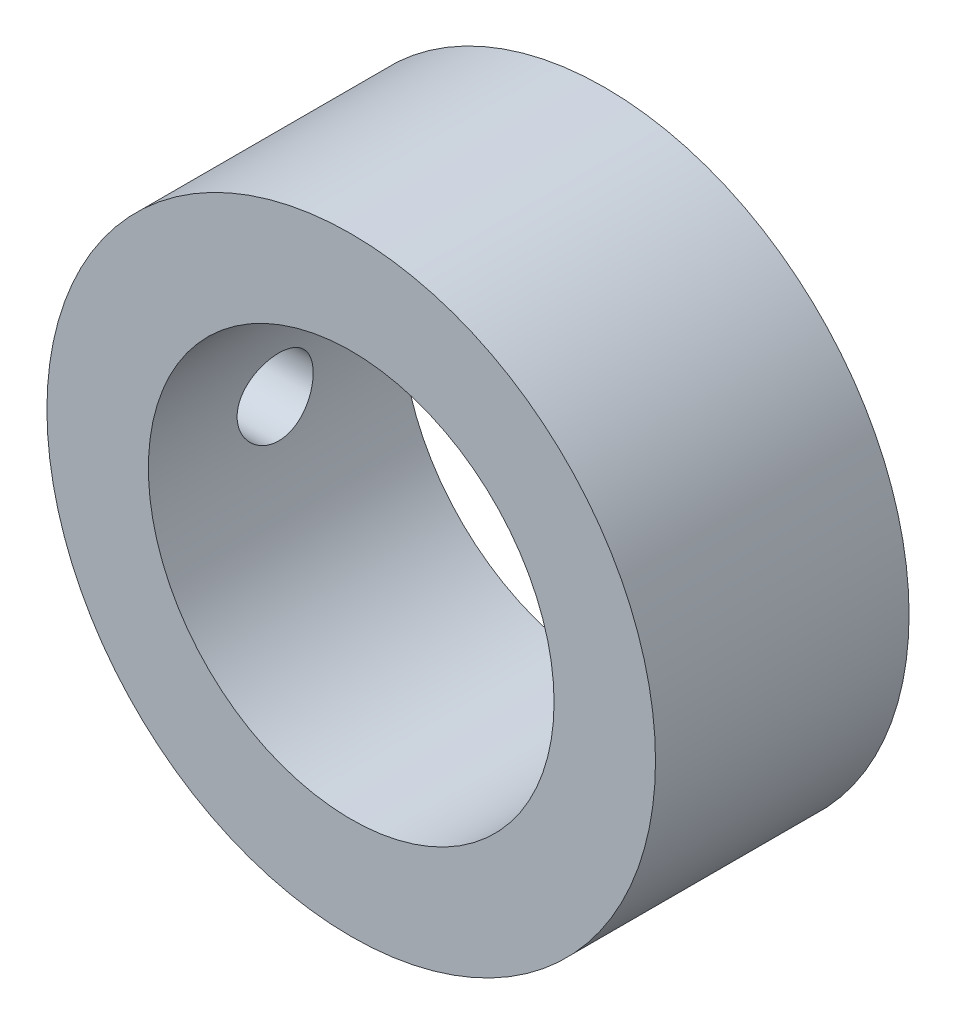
ISO-10303-21;
HEADER;
FILE_DESCRIPTION(('STEP AP214'),'2;1');
FILE_NAME('part.step','',(''),(''),'','','');
FILE_SCHEMA(('AUTOMOTIVE_DESIGN { 1 0 10303 214 1 1 1 1 }'));
ENDSEC;
DATA;
#1=APPLICATION_CONTEXT('core data for automotive mechanical design processes');
#2=APPLICATION_PROTOCOL_DEFINITION('international standard','automotive_design',2000,#1);
#3=PRODUCT_CONTEXT('',#1,'mechanical');
#4=PRODUCT('Part','Part','',(#3));
#5=PRODUCT_RELATED_PRODUCT_CATEGORY('part','',(#4));
#6=PRODUCT_DEFINITION_FORMATION('','',#4);
#7=PRODUCT_DEFINITION_CONTEXT('part definition',#1,'design');
#8=PRODUCT_DEFINITION('design','',#6,#7);
#9=PRODUCT_DEFINITION_SHAPE('','',#8);
#10=(LENGTH_UNIT() NAMED_UNIT(*) SI_UNIT(.MILLI.,.METRE.));
#11=(NAMED_UNIT(*) PLANE_ANGLE_UNIT() SI_UNIT($,.RADIAN.));
#12=(NAMED_UNIT(*) SI_UNIT($,.STERADIAN.) SOLID_ANGLE_UNIT());
#13=UNCERTAINTY_MEASURE_WITH_UNIT(LENGTH_MEASURE(1.E-05),#10,'distance_accuracy_value','');
#14=(GEOMETRIC_REPRESENTATION_CONTEXT(3) GLOBAL_UNCERTAINTY_ASSIGNED_CONTEXT((#13)) GLOBAL_UNIT_ASSIGNED_CONTEXT((#10,
#11,#12)) REPRESENTATION_CONTEXT('',''));
#15=CARTESIAN_POINT('',(0.,0.,0.));
#16=DIRECTION('',(0.,0.,1.));
#17=DIRECTION('',(1.,0.,0.));
#18=AXIS2_PLACEMENT_3D('',#15,#16,#17);
#19=CARTESIAN_POINT('',(0.,0.,5.));
#20=DIRECTION('',(0.,0.,1.));
#21=DIRECTION('',(1.,0.,0.));
#22=AXIS2_PLACEMENT_3D('',#19,#20,#21);
#23=PLANE('',#22);
#24=CARTESIAN_POINT('',(0.,0.,5.));
#25=DIRECTION('',(0.,0.,1.));
#26=DIRECTION('',(1.,0.,0.));
#27=AXIS2_PLACEMENT_3D('',#24,#25,#26);
#28=CIRCLE('',#27,6.);
#29=CARTESIAN_POINT('',(6.,0.,5.));
#30=VERTEX_POINT('',#29);
#31=EDGE_CURVE('E51',#30,#30,#28,.T.);
#32=ORIENTED_EDGE('',*,*,#31,.T.);
#33=EDGE_LOOP('',(#32));
#34=FACE_BOUND('',#33,.T.);
#35=CARTESIAN_POINT('',(0.,0.,5.));
#36=DIRECTION('',(0.,0.,1.));
#37=DIRECTION('',(1.,0.,0.));
#38=AXIS2_PLACEMENT_3D('',#35,#36,#37);
#39=CIRCLE('',#38,4.);
#40=CARTESIAN_POINT('',(4.,0.,5.));
#41=VERTEX_POINT('',#40);
#42=EDGE_CURVE('E60',#41,#41,#39,.T.);
#43=ORIENTED_EDGE('',*,*,#42,.F.);
#44=EDGE_LOOP('',(#43));
#45=FACE_BOUND('',#44,.T.);
#46=ADVANCED_FACE('F39',(#34,#45),#23,.T.);
#47=CARTESIAN_POINT('',(0.,0.,0.));
#48=DIRECTION('',(0.,0.,1.));
#49=DIRECTION('',(1.,0.,0.));
#50=AXIS2_PLACEMENT_3D('',#47,#48,#49);
#51=PLANE('',#50);
#52=CARTESIAN_POINT('',(0.,0.,0.));
#53=DIRECTION('',(0.,0.,1.));
#54=DIRECTION('',(1.,0.,0.));
#55=AXIS2_PLACEMENT_3D('',#52,#53,#54);
#56=CIRCLE('',#55,6.);
#57=CARTESIAN_POINT('',(6.,0.,0.));
#58=VERTEX_POINT('',#57);
#59=EDGE_CURVE('E55',#58,#58,#56,.T.);
#60=ORIENTED_EDGE('',*,*,#59,.F.);
#61=EDGE_LOOP('',(#60));
#62=FACE_BOUND('',#61,.T.);
#63=CARTESIAN_POINT('',(0.,0.,0.));
#64=DIRECTION('',(0.,0.,1.));
#65=DIRECTION('',(1.,0.,0.));
#66=AXIS2_PLACEMENT_3D('',#63,#64,#65);
#67=CIRCLE('',#66,4.);
#68=CARTESIAN_POINT('',(4.,0.,0.));
#69=VERTEX_POINT('',#68);
#70=EDGE_CURVE('E62',#69,#69,#67,.T.);
#71=ORIENTED_EDGE('',*,*,#70,.T.);
#72=EDGE_LOOP('',(#71));
#73=FACE_BOUND('',#72,.T.);
#74=ADVANCED_FACE('F87',(#62,#73),#51,.F.);
#75=CARTESIAN_POINT('',(0.,0.,5.));
#76=DIRECTION('',(0.,0.,-1.));
#77=DIRECTION('',(-1.,0.,0.));
#78=AXIS2_PLACEMENT_3D('',#75,#76,#77);
#79=CYLINDRICAL_SURFACE('',#78,6.);
#80=CARTESIAN_POINT('',(-6.,0.,3.25));
#81=CARTESIAN_POINT('',(-5.99999941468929,-0.0419523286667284,3.24999821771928));
#82=CARTESIAN_POINT('',(-5.99955535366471,-0.0839308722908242,3.24646813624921));
#83=CARTESIAN_POINT('',(-5.99782662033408,-0.166719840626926,3.23244167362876));
#84=CARTESIAN_POINT('',(-5.99654107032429,-0.207528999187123,3.22193801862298));
#85=CARTESIAN_POINT('',(-5.99327418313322,-0.286768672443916,3.19427870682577));
#86=CARTESIAN_POINT('',(-5.99129331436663,-0.325200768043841,3.17712752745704));
#87=CARTESIAN_POINT('',(-5.98685610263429,-0.39863384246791,3.13666981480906));
#88=CARTESIAN_POINT('',(-5.98439984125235,-0.433635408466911,3.11336433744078));
#89=CARTESIAN_POINT('',(-5.97927096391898,-0.499413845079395,3.06112241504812));
#90=CARTESIAN_POINT('',(-5.97659734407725,-0.530169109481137,3.03215886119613));
#91=CARTESIAN_POINT('',(-5.97134317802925,-0.586395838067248,2.96948115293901));
#92=CARTESIAN_POINT('',(-5.96876263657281,-0.611867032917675,2.93576675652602));
#93=CARTESIAN_POINT('',(-5.96397691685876,-0.656883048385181,2.8644040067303));
#94=CARTESIAN_POINT('',(-5.96177303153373,-0.676407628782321,2.82674279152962));
#95=CARTESIAN_POINT('',(-5.95800338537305,-0.708846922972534,2.74864388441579));
#96=CARTESIAN_POINT('',(-5.95643760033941,-0.721761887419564,2.70820629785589));
#97=CARTESIAN_POINT('',(-5.95413101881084,-0.740549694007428,2.62592674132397));
#98=CARTESIAN_POINT('',(-5.95338595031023,-0.74645901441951,2.58409322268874));
#99=CARTESIAN_POINT('',(-5.95279208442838,-0.751180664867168,2.50002212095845));
#100=CARTESIAN_POINT('',(-5.95294325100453,-0.749993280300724,2.45778455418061));
#101=CARTESIAN_POINT('',(-5.95412086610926,-0.74058517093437,2.37435855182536));
#102=CARTESIAN_POINT('',(-5.95514231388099,-0.732404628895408,2.33316550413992));
#103=CARTESIAN_POINT('',(-5.95793759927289,-0.709305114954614,2.2527414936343));
#104=CARTESIAN_POINT('',(-5.95971145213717,-0.69438600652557,2.21351057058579));
#105=CARTESIAN_POINT('',(-5.96381734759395,-0.658189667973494,2.13799960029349));
#106=CARTESIAN_POINT('',(-5.96615091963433,-0.63689497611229,2.1017280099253));
#107=CARTESIAN_POINT('',(-5.97111213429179,-0.588564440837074,2.03325799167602));
#108=CARTESIAN_POINT('',(-5.97373979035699,-0.561528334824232,2.0010597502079));
#109=CARTESIAN_POINT('',(-5.97901532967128,-0.502259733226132,1.94141718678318));
#110=CARTESIAN_POINT('',(-5.98166322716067,-0.469992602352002,1.9140072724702));
#111=CARTESIAN_POINT('',(-5.98666389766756,-0.401297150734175,1.86498733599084));
#112=CARTESIAN_POINT('',(-5.98901667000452,-0.364868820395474,1.8433773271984));
#113=CARTESIAN_POINT('',(-5.99316345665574,-0.288858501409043,1.80657060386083));
#114=CARTESIAN_POINT('',(-5.99495728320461,-0.249275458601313,1.79137604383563));
#115=CARTESIAN_POINT('',(-5.99778235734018,-0.168092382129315,1.76785885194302));
#116=CARTESIAN_POINT('',(-5.99881364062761,-0.126492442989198,1.75953589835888));
#117=CARTESIAN_POINT('',(-5.99999278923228,-0.0427539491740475,1.75004277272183));
#118=CARTESIAN_POINT('',(-6.00014650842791,-0.000620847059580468,1.74882520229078));
#119=CARTESIAN_POINT('',(-5.99956901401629,0.0832488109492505,1.75345232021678));
#120=CARTESIAN_POINT('',(-5.99883781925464,0.124985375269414,1.75929685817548));
#121=CARTESIAN_POINT('',(-5.99657630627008,0.206737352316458,1.77784291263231));
#122=CARTESIAN_POINT('',(-5.99504862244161,0.246757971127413,1.79052182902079));
#123=CARTESIAN_POINT('',(-5.99136516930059,0.324104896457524,1.82235323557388));
#124=CARTESIAN_POINT('',(-5.98920937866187,0.361431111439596,1.84150594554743));
#125=CARTESIAN_POINT('',(-5.98449546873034,0.432541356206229,1.88585594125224));
#126=CARTESIAN_POINT('',(-5.98193533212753,0.466306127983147,1.91108388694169));
#127=CARTESIAN_POINT('',(-5.97670542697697,0.529139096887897,1.96682484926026));
#128=CARTESIAN_POINT('',(-5.9740356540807,0.558207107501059,1.9973380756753));
#129=CARTESIAN_POINT('',(-5.96886931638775,0.610989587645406,2.06299222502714));
#130=CARTESIAN_POINT('',(-5.96637382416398,0.634672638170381,2.09815850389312));
#131=CARTESIAN_POINT('',(-5.96185623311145,0.675795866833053,2.17199747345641));
#132=CARTESIAN_POINT('',(-5.95983412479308,0.693236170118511,2.21067009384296));
#133=CARTESIAN_POINT('',(-5.95649955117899,0.721327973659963,2.29032259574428));
#134=CARTESIAN_POINT('',(-5.95518523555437,0.731997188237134,2.33129614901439));
#135=CARTESIAN_POINT('',(-5.95340974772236,0.746300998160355,2.4144707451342));
#136=CARTESIAN_POINT('',(-5.95294853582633,0.74993592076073,2.4566717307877));
#137=CARTESIAN_POINT('',(-5.95293263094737,0.750061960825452,2.5407906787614));
#138=CARTESIAN_POINT('',(-5.95337167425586,0.746602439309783,2.58270857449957));
#139=CARTESIAN_POINT('',(-5.9550933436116,0.732742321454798,2.66536213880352));
#140=CARTESIAN_POINT('',(-5.95637596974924,0.722341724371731,2.70609780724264));
#141=CARTESIAN_POINT('',(-5.95963834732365,0.694910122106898,2.78522408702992));
#142=CARTESIAN_POINT('',(-5.96161784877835,0.677881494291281,2.82361553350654));
#143=CARTESIAN_POINT('',(-5.96605134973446,0.637682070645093,2.8970039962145));
#144=CARTESIAN_POINT('',(-5.96850535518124,0.614511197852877,2.93200096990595));
#145=CARTESIAN_POINT('',(-5.9736318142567,0.562501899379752,2.99785936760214));
#146=CARTESIAN_POINT('',(-5.9763056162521,0.533626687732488,3.02869163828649));
#147=CARTESIAN_POINT('',(-5.9815584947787,0.471105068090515,3.08509204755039));
#148=CARTESIAN_POINT('',(-5.98413754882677,0.437457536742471,3.11065894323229));
#149=CARTESIAN_POINT('',(-5.98892116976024,0.366199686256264,3.15588560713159));
#150=CARTESIAN_POINT('',(-5.9911242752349,0.328574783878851,3.17552254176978));
#151=CARTESIAN_POINT('',(-5.99489294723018,0.250554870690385,3.20817137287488));
#152=CARTESIAN_POINT('',(-5.99645920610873,0.210162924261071,3.22119046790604));
#153=CARTESIAN_POINT('',(-5.99840016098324,0.141301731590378,3.23711780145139));
#154=CARTESIAN_POINT('',(-5.99899717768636,0.113266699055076,3.24194168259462));
#155=CARTESIAN_POINT('',(-5.99979729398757,0.0568251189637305,3.24838337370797));
#156=CARTESIAN_POINT('',(-6.00000039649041,0.0284185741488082,3.25000120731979));
#157=CARTESIAN_POINT('',(-6.,0.,3.25));
#158=B_SPLINE_CURVE_WITH_KNOTS('',3,(#80,#81,#82,#83,#84,#85,#86,#87,#88,#89,#90,#91,#92,#93,
#94,#95,#96,#97,#98,#99,#100,#101,#102,#103,#104,#105,#106,#107,#108,#109,#110,#111,#112,#113,
#114,#115,#116,#117,#118,#119,#120,#121,#122,#123,#124,#125,#126,#127,#128,#129,#130,#131,#132,
#133,#134,#135,#136,#137,#138,#139,#140,#141,#142,#143,#144,#145,#146,#147,#148,#149,#150,#151,
#152,#153,#154,#155,#156,#157),.UNSPECIFIED.,.T.,.F.,(4,2,2,2,2,2,2,2,2,2,2,2,2,2,2,2,2,2,2,2,2,
2,2,2,2,2,2,2,2,2,2,2,2,2,2,2,2,2,4),(0.,0.125753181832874,0.251637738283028,0.377437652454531,
0.503215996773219,0.629612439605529,0.756015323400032,0.882843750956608,1.00966736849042,
1.13582767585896,1.26198290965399,1.38741808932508,1.51285581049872,1.6386402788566,
1.76443050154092,1.89109043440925,2.01775065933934,2.14445338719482,2.27115018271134,
2.39700083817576,2.52284881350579,2.64828316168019,2.77372176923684,2.89980720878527,
3.02589765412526,3.15270591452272,3.27951163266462,3.40598422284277,3.53245092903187,
3.65804070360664,3.78363049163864,3.90917527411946,4.03472162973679,4.16110571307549,
4.28751959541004,4.41441420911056,4.5411704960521,4.62635652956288,4.71154193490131),.UNSPECIFIED.);
#159=CARTESIAN_POINT('',(-6.,0.,3.25));
#160=VERTEX_POINT('',#159);
#161=EDGE_CURVE('E10',#160,#160,#158,.T.);
#162=ORIENTED_EDGE('',*,*,#161,.T.);
#163=EDGE_LOOP('',(#162));
#164=FACE_BOUND('',#163,.T.);
#165=ORIENTED_EDGE('',*,*,#31,.F.);
#166=EDGE_LOOP('',(#165));
#167=FACE_BOUND('',#166,.T.);
#168=ORIENTED_EDGE('',*,*,#59,.T.);
#169=EDGE_LOOP('',(#168));
#170=FACE_BOUND('',#169,.T.);
#171=ADVANCED_FACE('F41',(#164,#167,#170),#79,.T.);
#172=CARTESIAN_POINT('',(0.,0.,5.));
#173=DIRECTION('',(0.,0.,-1.));
#174=DIRECTION('',(-1.,0.,0.));
#175=AXIS2_PLACEMENT_3D('',#172,#173,#174);
#176=CYLINDRICAL_SURFACE('',#175,4.);
#177=CARTESIAN_POINT('',(-4.,0.,3.25));
#178=CARTESIAN_POINT('',(-3.99999924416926,-0.0417358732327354,3.24999840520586));
#179=CARTESIAN_POINT('',(-3.99934004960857,-0.0834924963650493,3.24650446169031));
#180=CARTESIAN_POINT('',(-3.9967739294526,-0.165829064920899,3.23263000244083));
#181=CARTESIAN_POINT('',(-3.99486595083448,-0.206407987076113,3.22224367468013));
#182=CARTESIAN_POINT('',(-3.99001569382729,-0.285186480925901,3.19491364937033));
#183=CARTESIAN_POINT('',(-3.98707434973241,-0.323388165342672,3.17797587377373));
#184=CARTESIAN_POINT('',(-3.98047855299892,-0.396403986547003,3.13804056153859));
#185=CARTESIAN_POINT('',(-3.97682415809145,-0.431218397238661,3.11504351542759));
#186=CARTESIAN_POINT('',(-3.96915668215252,-0.496891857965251,3.06335011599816));
#187=CARTESIAN_POINT('',(-3.96514017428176,-0.527704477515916,3.03459527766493));
#188=CARTESIAN_POINT('',(-3.95722659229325,-0.584098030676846,2.97232834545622));
#189=CARTESIAN_POINT('',(-3.95332952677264,-0.609678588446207,2.93881591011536));
#190=CARTESIAN_POINT('',(-3.94606275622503,-0.655074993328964,2.86765695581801));
#191=CARTESIAN_POINT('',(-3.94269746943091,-0.674843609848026,2.82997981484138));
#192=CARTESIAN_POINT('',(-3.93692356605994,-0.707752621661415,2.7517655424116));
#193=CARTESIAN_POINT('',(-3.93451486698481,-0.72089358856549,2.71122865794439));
#194=CARTESIAN_POINT('',(-3.93096134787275,-0.7400252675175,2.62894238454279));
#195=CARTESIAN_POINT('',(-3.92980222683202,-0.746096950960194,2.58721245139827));
#196=CARTESIAN_POINT('',(-3.92883598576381,-0.751169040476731,2.50331130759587));
#197=CARTESIAN_POINT('',(-3.9290287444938,-0.750170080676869,2.46114013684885));
#198=CARTESIAN_POINT('',(-3.93073146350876,-0.741194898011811,2.37814023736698));
#199=CARTESIAN_POINT('',(-3.93222404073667,-0.733310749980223,2.33730114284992));
#200=CARTESIAN_POINT('',(-3.93633091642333,-0.710933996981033,2.25753579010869));
#201=CARTESIAN_POINT('',(-3.93894526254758,-0.696441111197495,2.21860961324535));
#202=CARTESIAN_POINT('',(-3.94501927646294,-0.661168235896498,2.14350566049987));
#203=CARTESIAN_POINT('',(-3.94848391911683,-0.640351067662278,2.10734576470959));
#204=CARTESIAN_POINT('',(-3.95586485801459,-0.593046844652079,2.03899763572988));
#205=CARTESIAN_POINT('',(-3.95978120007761,-0.566559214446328,2.0068098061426));
#206=CARTESIAN_POINT('',(-3.96770000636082,-0.508169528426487,1.94678752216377));
#207=CARTESIAN_POINT('',(-3.97170285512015,-0.476188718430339,1.91902967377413));
#208=CARTESIAN_POINT('',(-3.97928693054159,-0.407984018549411,1.8692613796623));
#209=CARTESIAN_POINT('',(-3.98286815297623,-0.371760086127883,1.84725099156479));
#210=CARTESIAN_POINT('',(-3.98921269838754,-0.296017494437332,1.80959112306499));
#211=CARTESIAN_POINT('',(-3.99197499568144,-0.256494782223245,1.79394961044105));
#212=CARTESIAN_POINT('',(-3.9963625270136,-0.175319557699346,1.76954895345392));
#213=CARTESIAN_POINT('',(-3.99798788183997,-0.133667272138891,1.76078907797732));
#214=CARTESIAN_POINT('',(-3.9999018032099,-0.0500743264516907,1.75050698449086));
#215=CARTESIAN_POINT('',(-4.00020975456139,-0.00814700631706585,1.74887980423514));
#216=CARTESIAN_POINT('',(-3.99950771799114,0.0753806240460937,1.75262773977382));
#217=CARTESIAN_POINT('',(-3.99849779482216,0.116980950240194,1.75800251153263));
#218=CARTESIAN_POINT('',(-3.99528555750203,0.19834078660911,1.77551451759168));
#219=CARTESIAN_POINT('',(-3.99309261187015,0.238112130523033,1.78759864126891));
#220=CARTESIAN_POINT('',(-3.98775921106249,0.315064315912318,1.81812885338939));
#221=CARTESIAN_POINT('',(-3.98461869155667,0.352244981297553,1.83657537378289));
#222=CARTESIAN_POINT('',(-3.97769015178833,0.423408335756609,1.87953906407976));
#223=CARTESIAN_POINT('',(-3.97389543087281,0.457351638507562,1.90412036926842));
#224=CARTESIAN_POINT('',(-3.96609671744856,0.520669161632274,1.95856906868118));
#225=CARTESIAN_POINT('',(-3.96209270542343,0.550042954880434,1.98843695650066));
#226=CARTESIAN_POINT('',(-3.95426237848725,0.603786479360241,2.05308615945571));
#227=CARTESIAN_POINT('',(-3.95043912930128,0.628084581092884,2.08792745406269));
#228=CARTESIAN_POINT('',(-3.94346492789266,0.670483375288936,2.16125881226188));
#229=CARTESIAN_POINT('',(-3.94031395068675,0.688584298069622,2.19974874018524));
#230=CARTESIAN_POINT('',(-3.93506512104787,0.717973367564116,2.27910293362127));
#231=CARTESIAN_POINT('',(-3.93296220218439,0.729294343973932,2.31995468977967));
#232=CARTESIAN_POINT('',(-3.93003601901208,0.744903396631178,2.4030236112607));
#233=CARTESIAN_POINT('',(-3.92921261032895,0.749192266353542,2.4452406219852));
#234=CARTESIAN_POINT('',(-3.92894599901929,0.750588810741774,2.52912416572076));
#235=CARTESIAN_POINT('',(-3.92948107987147,0.747809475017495,2.5707887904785));
#236=CARTESIAN_POINT('',(-3.93182300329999,0.735395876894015,2.65304571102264));
#237=CARTESIAN_POINT('',(-3.93362983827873,0.725761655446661,2.69363801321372));
#238=CARTESIAN_POINT('',(-3.9383025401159,0.699959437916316,2.77253724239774));
#239=CARTESIAN_POINT('',(-3.94116642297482,0.683803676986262,2.81084829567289));
#240=CARTESIAN_POINT('',(-3.9476319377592,0.645429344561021,2.88423412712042));
#241=CARTESIAN_POINT('',(-3.9512336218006,0.623210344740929,2.91930867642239));
#242=CARTESIAN_POINT('',(-3.95883633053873,0.572947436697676,2.98579184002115));
#243=CARTESIAN_POINT('',(-3.96284252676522,0.544821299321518,3.01713770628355));
#244=CARTESIAN_POINT('',(-3.97076416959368,0.483713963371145,3.07470258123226));
#245=CARTESIAN_POINT('',(-3.97467959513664,0.450731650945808,3.10092041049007));
#246=CARTESIAN_POINT('',(-3.98201987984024,0.380492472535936,3.14770547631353));
#247=CARTESIAN_POINT('',(-3.9854400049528,0.343199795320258,3.16821971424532));
#248=CARTESIAN_POINT('',(-3.99135809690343,0.265645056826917,3.20265881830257));
#249=CARTESIAN_POINT('',(-3.99385692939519,0.225385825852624,3.21658987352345));
#250=CARTESIAN_POINT('',(-3.99714145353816,0.154173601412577,3.23463865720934));
#251=CARTESIAN_POINT('',(-3.99820735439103,0.123636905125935,3.2403893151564));
#252=CARTESIAN_POINT('',(-3.99963689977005,0.0620706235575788,3.24807053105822));
#253=CARTESIAN_POINT('',(-4.00000056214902,0.0310410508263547,3.25000118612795));
#254=CARTESIAN_POINT('',(-4.,0.,3.25));
#255=B_SPLINE_CURVE_WITH_KNOTS('',3,(#177,#178,#179,#180,#181,#182,#183,#184,#185,#186,#187,
#188,#189,#190,#191,#192,#193,#194,#195,#196,#197,#198,#199,#200,#201,#202,#203,#204,#205,#206,
#207,#208,#209,#210,#211,#212,#213,#214,#215,#216,#217,#218,#219,#220,#221,#222,#223,#224,#225,
#226,#227,#228,#229,#230,#231,#232,#233,#234,#235,#236,#237,#238,#239,#240,#241,#242,#243,#244,
#245,#246,#247,#248,#249,#250,#251,#252,#253,#254),.UNSPECIFIED.,.T.,.F.,(4,2,2,2,2,2,2,2,2,2,2,
2,2,2,2,2,2,2,2,2,2,2,2,2,2,2,2,2,2,2,2,2,2,2,2,2,2,2,4),(0.,0.125094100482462,
0.250293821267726,0.375380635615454,0.500457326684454,0.626875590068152,0.753302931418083,
0.880730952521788,1.00814798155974,1.13409075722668,1.26002223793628,1.38429500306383,
1.50857304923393,1.63359631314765,1.7586322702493,1.88563884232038,2.01264668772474,
2.13981294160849,2.26696568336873,2.39224087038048,2.51750990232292,2.64180116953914,
2.76610087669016,2.89175889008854,3.01742864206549,3.14476718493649,3.27210099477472,
3.39881313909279,3.52551098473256,3.65019626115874,3.77488079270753,3.89933248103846,
4.02379296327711,4.1501168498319,4.27646975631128,4.40396024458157,4.53133063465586,
4.62437172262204,4.7174104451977),.UNSPECIFIED.);
#256=CARTESIAN_POINT('',(-4.,0.,3.25));
#257=VERTEX_POINT('',#256);
#258=EDGE_CURVE('E65',#257,#257,#255,.T.);
#259=ORIENTED_EDGE('',*,*,#258,.F.);
#260=EDGE_LOOP('',(#259));
#261=FACE_BOUND('',#260,.T.);
#262=ORIENTED_EDGE('',*,*,#42,.T.);
#263=EDGE_LOOP('',(#262));
#264=FACE_BOUND('',#263,.T.);
#265=ORIENTED_EDGE('',*,*,#70,.F.);
#266=EDGE_LOOP('',(#265));
#267=FACE_BOUND('',#266,.T.);
#268=ADVANCED_FACE('F73',(#261,#264,#267),#176,.F.);
#269=CARTESIAN_POINT('',(-6.,0.,2.5));
#270=DIRECTION('',(-1.,0.,0.));
#271=DIRECTION('',(0.,0.,1.));
#272=AXIS2_PLACEMENT_3D('',#269,#270,#271);
#273=CYLINDRICAL_SURFACE('',#272,0.75);
#274=ORIENTED_EDGE('',*,*,#258,.T.);
#275=EDGE_LOOP('',(#274));
#276=FACE_BOUND('',#275,.T.);
#277=ORIENTED_EDGE('',*,*,#161,.F.);
#278=EDGE_LOOP('',(#277));
#279=FACE_BOUND('',#278,.T.);
#280=ADVANCED_FACE('F76',(#276,#279),#273,.F.);
#281=CLOSED_SHELL('',(#46,#74,#171,#268,#280));
#282=MANIFOLD_SOLID_BREP('B2',#281);
#283=ADVANCED_BREP_SHAPE_REPRESENTATION('',(#18,#282),#14);
#284=SHAPE_DEFINITION_REPRESENTATION(#9,#283);
ENDSEC;
END-ISO-10303-21;
